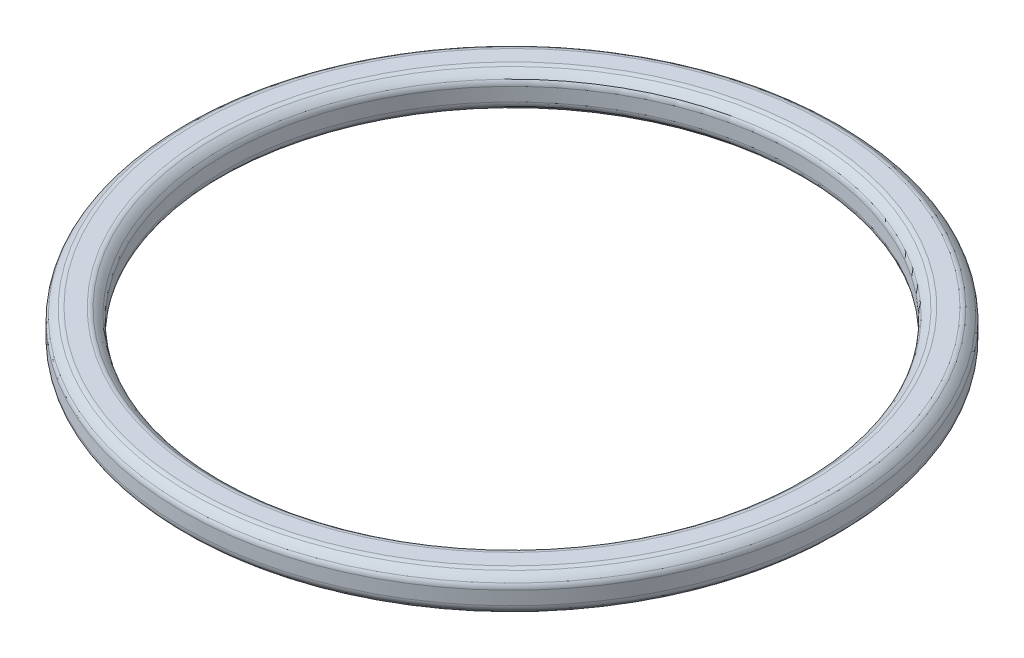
ISO-10303-21;
HEADER;
FILE_DESCRIPTION(('STEP AP214'),'2;1');
FILE_NAME('part.step','',(''),(''),'','','');
FILE_SCHEMA(('AUTOMOTIVE_DESIGN { 1 0 10303 214 1 1 1 1 }'));
ENDSEC;
DATA;
#1=APPLICATION_CONTEXT('core data for automotive mechanical design processes');
#2=APPLICATION_PROTOCOL_DEFINITION('international standard','automotive_design',2000,#1);
#3=PRODUCT_CONTEXT('',#1,'mechanical');
#4=PRODUCT('Part','Part','',(#3));
#5=PRODUCT_RELATED_PRODUCT_CATEGORY('part','',(#4));
#6=PRODUCT_DEFINITION_FORMATION('','',#4);
#7=PRODUCT_DEFINITION_CONTEXT('part definition',#1,'design');
#8=PRODUCT_DEFINITION('design','',#6,#7);
#9=PRODUCT_DEFINITION_SHAPE('','',#8);
#10=(LENGTH_UNIT() NAMED_UNIT(*) SI_UNIT(.MILLI.,.METRE.));
#11=(NAMED_UNIT(*) PLANE_ANGLE_UNIT() SI_UNIT($,.RADIAN.));
#12=(NAMED_UNIT(*) SI_UNIT($,.STERADIAN.) SOLID_ANGLE_UNIT());
#13=UNCERTAINTY_MEASURE_WITH_UNIT(LENGTH_MEASURE(1.E-05),#10,'distance_accuracy_value','');
#14=(GEOMETRIC_REPRESENTATION_CONTEXT(3) GLOBAL_UNCERTAINTY_ASSIGNED_CONTEXT((#13)) GLOBAL_UNIT_ASSIGNED_CONTEXT((#10,
#11,#12)) REPRESENTATION_CONTEXT('',''));
#15=CARTESIAN_POINT('',(0.,0.,0.));
#16=DIRECTION('',(0.,0.,1.));
#17=DIRECTION('',(1.,0.,0.));
#18=AXIS2_PLACEMENT_3D('',#15,#16,#17);
#19=CARTESIAN_POINT('',(10.3,0.63,0.));
#20=DIRECTION('',(0.,0.,1.));
#21=DIRECTION('',(1.,0.,0.));
#22=AXIS2_PLACEMENT_3D('',#19,#20,#21);
#23=ELLIPSE('',#22,0.777777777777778,0.7);
#24=CARTESIAN_POINT('',(0.,0.,0.));
#25=DIRECTION('',(0.,-1.,0.));
#26=AXIS1_PLACEMENT('',#24,#25);
#27=SURFACE_OF_REVOLUTION('',#23,#26);
#28=CARTESIAN_POINT('',(0.,1.224281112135,0.));
#29=DIRECTION('',(0.,-1.,0.));
#30=DIRECTION('',(0.,0.,-1.));
#31=AXIS2_PLACEMENT_3D('',#28,#29,#30);
#32=CIRCLE('',#31,10.7110059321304);
#33=CARTESIAN_POINT('',(0.,1.224281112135,-10.7110059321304));
#34=VERTEX_POINT('',#33);
#35=EDGE_CURVE('E64',#34,#34,#32,.T.);
#36=ORIENTED_EDGE('',*,*,#35,.T.);
#37=EDGE_LOOP('',(#36));
#38=FACE_BOUND('',#37,.T.);
#39=CARTESIAN_POINT('',(0.,1.02309259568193,0.));
#40=DIRECTION('',(0.,-1.,0.));
#41=DIRECTION('',(0.,0.,-1.));
#42=AXIS2_PLACEMENT_3D('',#39,#40,#41);
#43=CIRCLE('',#42,10.9435608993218);
#44=CARTESIAN_POINT('',(0.,1.02309259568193,-10.9435608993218));
#45=VERTEX_POINT('',#44);
#46=EDGE_CURVE('E67',#45,#45,#43,.F.);
#47=ORIENTED_EDGE('',*,*,#46,.T.);
#48=EDGE_LOOP('',(#47));
#49=FACE_BOUND('',#48,.T.);
#50=ADVANCED_FACE('F14',(#38,#49),#27,.F.);
#51=CARTESIAN_POINT('',(9.9609745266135,1.26,0.));
#52=DIRECTION('',(0.,1.,0.));
#53=DIRECTION('',(0.,0.,1.));
#54=AXIS2_PLACEMENT_3D('',#51,#52,#53);
#55=PLANE('',#54);
#56=CARTESIAN_POINT('',(0.,1.26,0.));
#57=DIRECTION('',(0.,1.,0.));
#58=DIRECTION('',(0.,0.,1.));
#59=AXIS2_PLACEMENT_3D('',#56,#57,#58);
#60=CIRCLE('',#59,10.5741602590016);
#61=CARTESIAN_POINT('',(0.,1.26,10.5741602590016));
#62=VERTEX_POINT('',#61);
#63=EDGE_CURVE('E58',#62,#62,#60,.T.);
#64=ORIENTED_EDGE('',*,*,#63,.T.);
#65=EDGE_LOOP('',(#64));
#66=FACE_BOUND('',#65,.T.);
#67=CARTESIAN_POINT('',(0.,1.26,0.));
#68=DIRECTION('',(0.,1.,0.));
#69=DIRECTION('',(0.,0.,1.));
#70=AXIS2_PLACEMENT_3D('',#67,#68,#69);
#71=CIRCLE('',#70,10.0258397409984);
#72=CARTESIAN_POINT('',(0.,1.26,10.0258397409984));
#73=VERTEX_POINT('',#72);
#74=EDGE_CURVE('E61',#73,#73,#71,.F.);
#75=ORIENTED_EDGE('',*,*,#74,.T.);
#76=EDGE_LOOP('',(#75));
#77=FACE_BOUND('',#76,.T.);
#78=ADVANCED_FACE('F96',(#66,#77),#55,.T.);
#79=CARTESIAN_POINT('',(10.3,0.63,0.));
#80=DIRECTION('',(0.,0.,1.));
#81=DIRECTION('',(1.,0.,0.));
#82=AXIS2_PLACEMENT_3D('',#79,#80,#81);
#83=ELLIPSE('',#82,0.777777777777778,0.7);
#84=CARTESIAN_POINT('',(0.,0.,0.));
#85=DIRECTION('',(0.,-1.,0.));
#86=AXIS1_PLACEMENT('',#84,#85);
#87=SURFACE_OF_REVOLUTION('',#83,#86);
#88=CARTESIAN_POINT('',(0.,1.224281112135,0.));
#89=DIRECTION('',(0.,-1.,0.));
#90=DIRECTION('',(0.,0.,-1.));
#91=AXIS2_PLACEMENT_3D('',#88,#89,#90);
#92=CIRCLE('',#91,9.88899406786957);
#93=CARTESIAN_POINT('',(0.,1.224281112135,-9.88899406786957));
#94=VERTEX_POINT('',#93);
#95=EDGE_CURVE('E52',#94,#94,#92,.F.);
#96=ORIENTED_EDGE('',*,*,#95,.T.);
#97=EDGE_LOOP('',(#96));
#98=FACE_BOUND('',#97,.T.);
#99=CARTESIAN_POINT('',(0.,1.02309259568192,0.));
#100=DIRECTION('',(0.,-1.,0.));
#101=DIRECTION('',(0.,0.,-1.));
#102=AXIS2_PLACEMENT_3D('',#99,#100,#101);
#103=CIRCLE('',#102,9.65643910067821);
#104=CARTESIAN_POINT('',(0.,1.02309259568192,-9.65643910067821));
#105=VERTEX_POINT('',#104);
#106=EDGE_CURVE('E55',#105,#105,#103,.T.);
#107=ORIENTED_EDGE('',*,*,#106,.T.);
#108=EDGE_LOOP('',(#107));
#109=FACE_BOUND('',#108,.T.);
#110=ADVANCED_FACE('F92',(#98,#109),#87,.F.);
#111=CARTESIAN_POINT('',(0.,0.,0.));
#112=DIRECTION('',(0.,-1.,0.));
#113=DIRECTION('',(0.,0.,-1.));
#114=AXIS2_PLACEMENT_3D('',#111,#112,#113);
#115=CYLINDRICAL_SURFACE('',#114,9.6);
#116=CARTESIAN_POINT('',(0.,0.8545087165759,0.));
#117=DIRECTION('',(0.,1.,0.));
#118=DIRECTION('',(0.,0.,1.));
#119=AXIS2_PLACEMENT_3D('',#116,#117,#118);
#120=CIRCLE('',#119,9.6);
#121=CARTESIAN_POINT('',(0.,0.8545087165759,9.6));
#122=VERTEX_POINT('',#121);
#123=EDGE_CURVE('E46',#122,#122,#120,.T.);
#124=ORIENTED_EDGE('',*,*,#123,.T.);
#125=EDGE_LOOP('',(#124));
#126=FACE_BOUND('',#125,.T.);
#127=CARTESIAN_POINT('',(0.,0.4054912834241,0.));
#128=DIRECTION('',(0.,1.,0.));
#129=DIRECTION('',(0.,0.,1.));
#130=AXIS2_PLACEMENT_3D('',#127,#128,#129);
#131=CIRCLE('',#130,9.6);
#132=CARTESIAN_POINT('',(0.,0.4054912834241,9.6));
#133=VERTEX_POINT('',#132);
#134=EDGE_CURVE('E49',#133,#133,#131,.F.);
#135=ORIENTED_EDGE('',*,*,#134,.T.);
#136=EDGE_LOOP('',(#135));
#137=FACE_BOUND('',#136,.T.);
#138=ADVANCED_FACE('F88',(#126,#137),#115,.F.);
#139=CARTESIAN_POINT('',(10.3,0.63,0.));
#140=DIRECTION('',(0.,0.,1.));
#141=DIRECTION('',(1.,0.,0.));
#142=AXIS2_PLACEMENT_3D('',#139,#140,#141);
#143=ELLIPSE('',#142,0.777777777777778,0.7);
#144=CARTESIAN_POINT('',(0.,0.,0.));
#145=DIRECTION('',(0.,-1.,0.));
#146=AXIS1_PLACEMENT('',#144,#145);
#147=SURFACE_OF_REVOLUTION('',#143,#146);
#148=CARTESIAN_POINT('',(0.,0.23690740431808,0.));
#149=DIRECTION('',(0.,-1.,0.));
#150=DIRECTION('',(0.,0.,-1.));
#151=AXIS2_PLACEMENT_3D('',#148,#149,#150);
#152=CIRCLE('',#151,9.65643910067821);
#153=CARTESIAN_POINT('',(0.,0.23690740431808,-9.65643910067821));
#154=VERTEX_POINT('',#153);
#155=EDGE_CURVE('E40',#154,#154,#152,.F.);
#156=ORIENTED_EDGE('',*,*,#155,.T.);
#157=EDGE_LOOP('',(#156));
#158=FACE_BOUND('',#157,.T.);
#159=CARTESIAN_POINT('',(0.,0.0357188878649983,0.));
#160=DIRECTION('',(0.,-1.,0.));
#161=DIRECTION('',(0.,0.,-1.));
#162=AXIS2_PLACEMENT_3D('',#159,#160,#161);
#163=CIRCLE('',#162,9.88899406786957);
#164=CARTESIAN_POINT('',(0.,0.0357188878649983,-9.88899406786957));
#165=VERTEX_POINT('',#164);
#166=EDGE_CURVE('E43',#165,#165,#163,.T.);
#167=ORIENTED_EDGE('',*,*,#166,.T.);
#168=EDGE_LOOP('',(#167));
#169=FACE_BOUND('',#168,.T.);
#170=ADVANCED_FACE('F84',(#158,#169),#147,.F.);
#171=CARTESIAN_POINT('',(9.9609745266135,0.,0.));
#172=DIRECTION('',(0.,-1.,0.));
#173=DIRECTION('',(0.,0.,-1.));
#174=AXIS2_PLACEMENT_3D('',#171,#172,#173);
#175=PLANE('',#174);
#176=CARTESIAN_POINT('',(0.,0.,0.));
#177=DIRECTION('',(0.,-1.,0.));
#178=DIRECTION('',(0.,0.,-1.));
#179=AXIS2_PLACEMENT_3D('',#176,#177,#178);
#180=CIRCLE('',#179,10.0258397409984);
#181=CARTESIAN_POINT('',(0.,0.,-10.0258397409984));
#182=VERTEX_POINT('',#181);
#183=EDGE_CURVE('E34',#182,#182,#180,.F.);
#184=ORIENTED_EDGE('',*,*,#183,.T.);
#185=EDGE_LOOP('',(#184));
#186=FACE_BOUND('',#185,.T.);
#187=CARTESIAN_POINT('',(0.,0.,0.));
#188=DIRECTION('',(0.,-1.,0.));
#189=DIRECTION('',(0.,0.,-1.));
#190=AXIS2_PLACEMENT_3D('',#187,#188,#189);
#191=CIRCLE('',#190,10.5741602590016);
#192=CARTESIAN_POINT('',(0.,0.,-10.5741602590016));
#193=VERTEX_POINT('',#192);
#194=EDGE_CURVE('E37',#193,#193,#191,.T.);
#195=ORIENTED_EDGE('',*,*,#194,.T.);
#196=EDGE_LOOP('',(#195));
#197=FACE_BOUND('',#196,.T.);
#198=ADVANCED_FACE('F80',(#186,#197),#175,.T.);
#199=CARTESIAN_POINT('',(10.3,0.63,0.));
#200=DIRECTION('',(0.,0.,1.));
#201=DIRECTION('',(1.,0.,0.));
#202=AXIS2_PLACEMENT_3D('',#199,#200,#201);
#203=ELLIPSE('',#202,0.777777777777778,0.7);
#204=CARTESIAN_POINT('',(0.,0.,0.));
#205=DIRECTION('',(0.,-1.,0.));
#206=AXIS1_PLACEMENT('',#204,#205);
#207=SURFACE_OF_REVOLUTION('',#203,#206);
#208=CARTESIAN_POINT('',(0.,0.0357188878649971,0.));
#209=DIRECTION('',(0.,-1.,0.));
#210=DIRECTION('',(0.,0.,-1.));
#211=AXIS2_PLACEMENT_3D('',#208,#209,#210);
#212=CIRCLE('',#211,10.7110059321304);
#213=CARTESIAN_POINT('',(0.,0.0357188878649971,-10.7110059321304));
#214=VERTEX_POINT('',#213);
#215=EDGE_CURVE('E25',#214,#214,#212,.F.);
#216=ORIENTED_EDGE('',*,*,#215,.T.);
#217=EDGE_LOOP('',(#216));
#218=FACE_BOUND('',#217,.T.);
#219=CARTESIAN_POINT('',(0.,0.236907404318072,0.));
#220=DIRECTION('',(0.,-1.,0.));
#221=DIRECTION('',(0.,0.,-1.));
#222=AXIS2_PLACEMENT_3D('',#219,#220,#221);
#223=CIRCLE('',#222,10.9435608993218);
#224=CARTESIAN_POINT('',(0.,0.236907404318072,-10.9435608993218));
#225=VERTEX_POINT('',#224);
#226=EDGE_CURVE('E29',#225,#225,#223,.T.);
#227=ORIENTED_EDGE('',*,*,#226,.T.);
#228=EDGE_LOOP('',(#227));
#229=FACE_BOUND('',#228,.T.);
#230=ADVANCED_FACE('F75',(#218,#229),#207,.F.);
#231=CARTESIAN_POINT('',(0.,0.,0.));
#232=DIRECTION('',(0.,-1.,0.));
#233=DIRECTION('',(0.,0.,-1.));
#234=AXIS2_PLACEMENT_3D('',#231,#232,#233);
#235=CYLINDRICAL_SURFACE('',#234,11.);
#236=CARTESIAN_POINT('',(0.,0.405491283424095,0.));
#237=DIRECTION('',(0.,1.,0.));
#238=DIRECTION('',(0.,0.,1.));
#239=AXIS2_PLACEMENT_3D('',#236,#237,#238);
#240=CIRCLE('',#239,11.);
#241=CARTESIAN_POINT('',(0.,0.405491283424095,11.));
#242=VERTEX_POINT('',#241);
#243=EDGE_CURVE('E10',#242,#242,#240,.T.);
#244=ORIENTED_EDGE('',*,*,#243,.T.);
#245=EDGE_LOOP('',(#244));
#246=FACE_BOUND('',#245,.T.);
#247=CARTESIAN_POINT('',(0.,0.854508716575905,0.));
#248=DIRECTION('',(0.,1.,0.));
#249=DIRECTION('',(0.,0.,1.));
#250=AXIS2_PLACEMENT_3D('',#247,#248,#249);
#251=CIRCLE('',#250,11.);
#252=CARTESIAN_POINT('',(0.,0.854508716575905,11.));
#253=VERTEX_POINT('',#252);
#254=EDGE_CURVE('E21',#253,#253,#251,.F.);
#255=ORIENTED_EDGE('',*,*,#254,.T.);
#256=EDGE_LOOP('',(#255));
#257=FACE_BOUND('',#256,.T.);
#258=ADVANCED_FACE('F79',(#246,#257),#235,.T.);
#259=CARTESIAN_POINT('',(0.,0.98,0.));
#260=DIRECTION('',(0.,-1.,0.));
#261=DIRECTION('',(0.,0.,-1.));
#262=AXIS2_PLACEMENT_3D('',#259,#260,#261);
#263=TOROIDAL_SURFACE('',#262,10.5741602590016,0.28);
#264=ORIENTED_EDGE('',*,*,#63,.F.);
#265=EDGE_LOOP('',(#264));
#266=FACE_BOUND('',#265,.T.);
#267=ORIENTED_EDGE('',*,*,#35,.F.);
#268=EDGE_LOOP('',(#267));
#269=FACE_BOUND('',#268,.T.);
#270=ADVANCED_FACE('F105',(#266,#269),#263,.T.);
#271=CARTESIAN_POINT('',(0.,0.98,0.));
#272=DIRECTION('',(0.,-1.,0.));
#273=DIRECTION('',(0.,0.,-1.));
#274=AXIS2_PLACEMENT_3D('',#271,#272,#273);
#275=TOROIDAL_SURFACE('',#274,10.0258397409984,0.28);
#276=ORIENTED_EDGE('',*,*,#95,.F.);
#277=EDGE_LOOP('',(#276));
#278=FACE_BOUND('',#277,.T.);
#279=ORIENTED_EDGE('',*,*,#74,.F.);
#280=EDGE_LOOP('',(#279));
#281=FACE_BOUND('',#280,.T.);
#282=ADVANCED_FACE('F108',(#278,#281),#275,.T.);
#283=CARTESIAN_POINT('',(0.,0.8545087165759,0.));
#284=DIRECTION('',(0.,1.,0.));
#285=DIRECTION('',(0.,0.,1.));
#286=AXIS2_PLACEMENT_3D('',#283,#284,#285);
#287=TOROIDAL_SURFACE('',#286,9.88,0.28);
#288=ORIENTED_EDGE('',*,*,#123,.F.);
#289=EDGE_LOOP('',(#288));
#290=FACE_BOUND('',#289,.T.);
#291=ORIENTED_EDGE('',*,*,#106,.F.);
#292=EDGE_LOOP('',(#291));
#293=FACE_BOUND('',#292,.T.);
#294=ADVANCED_FACE('F112',(#290,#293),#287,.T.);
#295=CARTESIAN_POINT('',(0.,0.4054912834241,0.));
#296=DIRECTION('',(0.,1.,0.));
#297=DIRECTION('',(0.,0.,1.));
#298=AXIS2_PLACEMENT_3D('',#295,#296,#297);
#299=TOROIDAL_SURFACE('',#298,9.88,0.28);
#300=ORIENTED_EDGE('',*,*,#155,.F.);
#301=EDGE_LOOP('',(#300));
#302=FACE_BOUND('',#301,.T.);
#303=ORIENTED_EDGE('',*,*,#134,.F.);
#304=EDGE_LOOP('',(#303));
#305=FACE_BOUND('',#304,.T.);
#306=ADVANCED_FACE('F116',(#302,#305),#299,.T.);
#307=CARTESIAN_POINT('',(0.,0.28,0.));
#308=DIRECTION('',(0.,-1.,0.));
#309=DIRECTION('',(0.,0.,-1.));
#310=AXIS2_PLACEMENT_3D('',#307,#308,#309);
#311=TOROIDAL_SURFACE('',#310,10.0258397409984,0.28);
#312=ORIENTED_EDGE('',*,*,#183,.F.);
#313=EDGE_LOOP('',(#312));
#314=FACE_BOUND('',#313,.T.);
#315=ORIENTED_EDGE('',*,*,#166,.F.);
#316=EDGE_LOOP('',(#315));
#317=FACE_BOUND('',#316,.T.);
#318=ADVANCED_FACE('F120',(#314,#317),#311,.T.);
#319=CARTESIAN_POINT('',(0.,0.28,0.));
#320=DIRECTION('',(0.,-1.,0.));
#321=DIRECTION('',(0.,0.,-1.));
#322=AXIS2_PLACEMENT_3D('',#319,#320,#321);
#323=TOROIDAL_SURFACE('',#322,10.5741602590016,0.28);
#324=ORIENTED_EDGE('',*,*,#215,.F.);
#325=EDGE_LOOP('',(#324));
#326=FACE_BOUND('',#325,.T.);
#327=ORIENTED_EDGE('',*,*,#194,.F.);
#328=EDGE_LOOP('',(#327));
#329=FACE_BOUND('',#328,.T.);
#330=ADVANCED_FACE('F124',(#326,#329),#323,.T.);
#331=CARTESIAN_POINT('',(0.,0.405491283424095,0.));
#332=DIRECTION('',(0.,1.,0.));
#333=DIRECTION('',(0.,0.,1.));
#334=AXIS2_PLACEMENT_3D('',#331,#332,#333);
#335=TOROIDAL_SURFACE('',#334,10.72,0.28);
#336=ORIENTED_EDGE('',*,*,#243,.F.);
#337=EDGE_LOOP('',(#336));
#338=FACE_BOUND('',#337,.T.);
#339=ORIENTED_EDGE('',*,*,#226,.F.);
#340=EDGE_LOOP('',(#339));
#341=FACE_BOUND('',#340,.T.);
#342=ADVANCED_FACE('F127',(#338,#341),#335,.T.);
#343=CARTESIAN_POINT('',(0.,0.854508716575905,0.));
#344=DIRECTION('',(0.,1.,0.));
#345=DIRECTION('',(0.,0.,1.));
#346=AXIS2_PLACEMENT_3D('',#343,#344,#345);
#347=TOROIDAL_SURFACE('',#346,10.72,0.28);
#348=ORIENTED_EDGE('',*,*,#46,.F.);
#349=EDGE_LOOP('',(#348));
#350=FACE_BOUND('',#349,.T.);
#351=ORIENTED_EDGE('',*,*,#254,.F.);
#352=EDGE_LOOP('',(#351));
#353=FACE_BOUND('',#352,.T.);
#354=ADVANCED_FACE('F16',(#350,#353),#347,.T.);
#355=CLOSED_SHELL('',(#50,#78,#110,#138,#170,#198,#230,#258,#270,#282,#294,#306,#318,#330,#342,#354));
#356=MANIFOLD_SOLID_BREP('B1',#355);
#357=ADVANCED_BREP_SHAPE_REPRESENTATION('',(#18,#356),#14);
#358=SHAPE_DEFINITION_REPRESENTATION(#9,#357);
ENDSEC;
END-ISO-10303-21;
